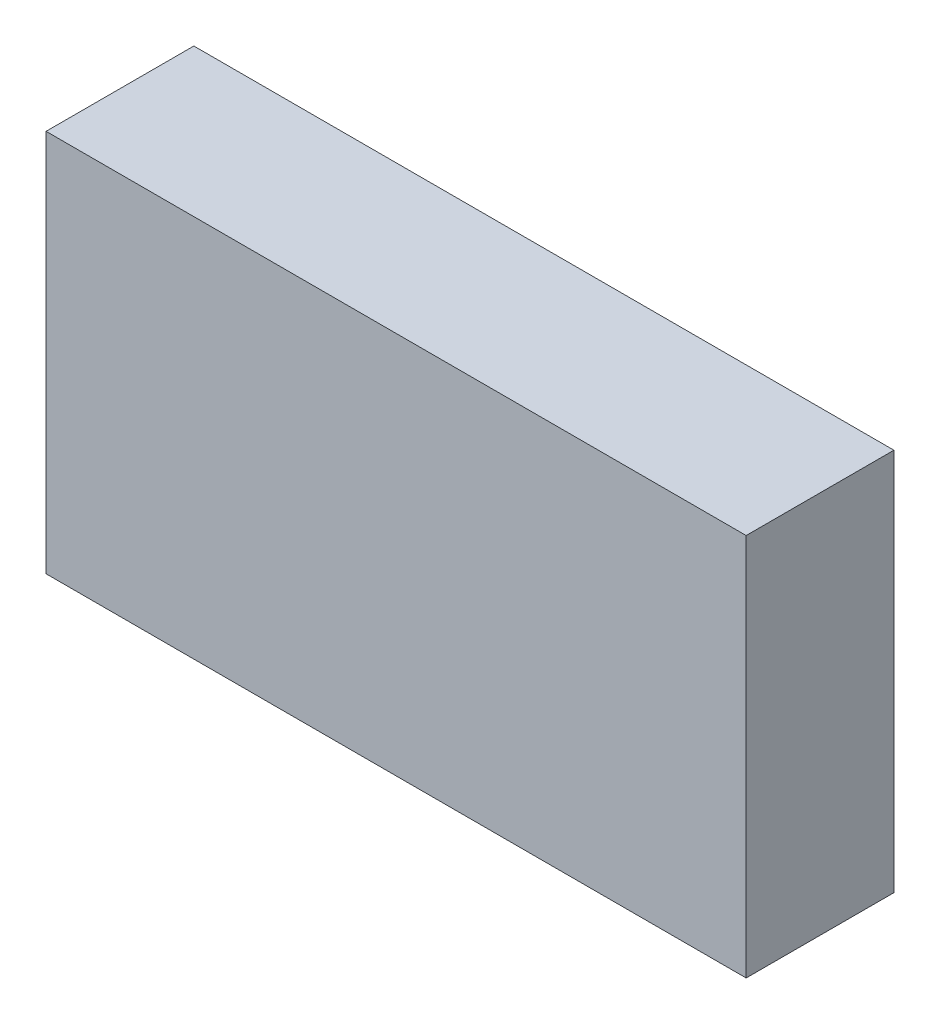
ISO-10303-21;
HEADER;
FILE_DESCRIPTION(('STEP AP214'),'2;1');
FILE_NAME('part.step','',(''),(''),'','','');
FILE_SCHEMA(('AUTOMOTIVE_DESIGN { 1 0 10303 214 1 1 1 1 }'));
ENDSEC;
DATA;
#1=APPLICATION_CONTEXT('core data for automotive mechanical design processes');
#2=APPLICATION_PROTOCOL_DEFINITION('international standard','automotive_design',2000,#1);
#3=PRODUCT_CONTEXT('',#1,'mechanical');
#4=PRODUCT('Part','Part','',(#3));
#5=PRODUCT_RELATED_PRODUCT_CATEGORY('part','',(#4));
#6=PRODUCT_DEFINITION_FORMATION('','',#4);
#7=PRODUCT_DEFINITION_CONTEXT('part definition',#1,'design');
#8=PRODUCT_DEFINITION('design','',#6,#7);
#9=PRODUCT_DEFINITION_SHAPE('','',#8);
#10=(LENGTH_UNIT() NAMED_UNIT(*) SI_UNIT(.MILLI.,.METRE.));
#11=(NAMED_UNIT(*) PLANE_ANGLE_UNIT() SI_UNIT($,.RADIAN.));
#12=(NAMED_UNIT(*) SI_UNIT($,.STERADIAN.) SOLID_ANGLE_UNIT());
#13=UNCERTAINTY_MEASURE_WITH_UNIT(LENGTH_MEASURE(1.E-05),#10,'distance_accuracy_value','');
#14=(GEOMETRIC_REPRESENTATION_CONTEXT(3) GLOBAL_UNCERTAINTY_ASSIGNED_CONTEXT((#13)) GLOBAL_UNIT_ASSIGNED_CONTEXT((#10,
#11,#12)) REPRESENTATION_CONTEXT('',''));
#15=CARTESIAN_POINT('',(0.,0.,0.));
#16=DIRECTION('',(0.,0.,1.));
#17=DIRECTION('',(1.,0.,0.));
#18=AXIS2_PLACEMENT_3D('',#15,#16,#17);
#19=CARTESIAN_POINT('',(-85.0123653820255,46.533357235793,35.8867617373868));
#20=DIRECTION('',(1.,0.,0.));
#21=DIRECTION('',(0.,1.,0.));
#22=AXIS2_PLACEMENT_3D('',#19,#20,#21);
#23=PLANE('',#22);
#24=DIRECTION('',(0.,-1.,0.));
#25=VECTOR('',#24,1.);
#26=CARTESIAN_POINT('',(-85.0123653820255,46.533357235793,0.));
#27=LINE('',#26,#25);
#28=CARTESIAN_POINT('',(-85.0123653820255,46.533357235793,0.));
#29=VERTEX_POINT('',#28);
#30=CARTESIAN_POINT('',(-85.0123653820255,-46.5333572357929,0.));
#31=VERTEX_POINT('',#30);
#32=EDGE_CURVE('E75',#29,#31,#27,.T.);
#33=ORIENTED_EDGE('',*,*,#32,.T.);
#34=DIRECTION('',(0.,0.,-1.));
#35=VECTOR('',#34,1.);
#36=CARTESIAN_POINT('',(-85.0123653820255,-46.5333572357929,35.8867617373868));
#37=LINE('',#36,#35);
#38=CARTESIAN_POINT('',(-85.0123653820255,-46.5333572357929,35.8867617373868));
#39=VERTEX_POINT('',#38);
#40=EDGE_CURVE('E11',#39,#31,#37,.T.);
#41=ORIENTED_EDGE('',*,*,#40,.F.);
#42=DIRECTION('',(0.,-1.,0.));
#43=VECTOR('',#42,1.);
#44=CARTESIAN_POINT('',(-85.0123653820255,46.533357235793,35.8867617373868));
#45=LINE('',#44,#43);
#46=CARTESIAN_POINT('',(-85.0123653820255,46.533357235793,35.8867617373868));
#47=VERTEX_POINT('',#46);
#48=EDGE_CURVE('E93',#47,#39,#45,.T.);
#49=ORIENTED_EDGE('',*,*,#48,.F.);
#50=DIRECTION('',(0.,0.,-1.));
#51=VECTOR('',#50,1.);
#52=CARTESIAN_POINT('',(-85.0123653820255,46.533357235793,35.8867617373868));
#53=LINE('',#52,#51);
#54=EDGE_CURVE('E87',#47,#29,#53,.T.);
#55=ORIENTED_EDGE('',*,*,#54,.T.);
#56=EDGE_LOOP('',(#33,#41,#49,#55));
#57=FACE_BOUND('',#56,.T.);
#58=ADVANCED_FACE('F31',(#57),#23,.F.);
#59=CARTESIAN_POINT('',(-85.0123653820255,-46.5333572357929,35.8867617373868));
#60=DIRECTION('',(0.,1.,0.));
#61=DIRECTION('',(0.,0.,1.));
#62=AXIS2_PLACEMENT_3D('',#59,#60,#61);
#63=PLANE('',#62);
#64=DIRECTION('',(1.,0.,0.));
#65=VECTOR('',#64,1.);
#66=CARTESIAN_POINT('',(-85.0123653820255,-46.5333572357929,0.));
#67=LINE('',#66,#65);
#68=CARTESIAN_POINT('',(85.0123653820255,-46.5333572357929,0.));
#69=VERTEX_POINT('',#68);
#70=EDGE_CURVE('E71',#31,#69,#67,.T.);
#71=ORIENTED_EDGE('',*,*,#70,.T.);
#72=DIRECTION('',(0.,0.,-1.));
#73=VECTOR('',#72,1.);
#74=CARTESIAN_POINT('',(85.0123653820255,-46.5333572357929,35.8867617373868));
#75=LINE('',#74,#73);
#76=CARTESIAN_POINT('',(85.0123653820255,-46.5333572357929,35.8867617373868));
#77=VERTEX_POINT('',#76);
#78=EDGE_CURVE('E38',#77,#69,#75,.T.);
#79=ORIENTED_EDGE('',*,*,#78,.F.);
#80=DIRECTION('',(1.,0.,0.));
#81=VECTOR('',#80,1.);
#82=CARTESIAN_POINT('',(-85.0123653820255,-46.5333572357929,35.8867617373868));
#83=LINE('',#82,#81);
#84=EDGE_CURVE('E83',#39,#77,#83,.T.);
#85=ORIENTED_EDGE('',*,*,#84,.F.);
#86=ORIENTED_EDGE('',*,*,#40,.T.);
#87=EDGE_LOOP('',(#71,#79,#85,#86));
#88=FACE_BOUND('',#87,.T.);
#89=ADVANCED_FACE('F82',(#88),#63,.F.);
#90=CARTESIAN_POINT('',(85.0123653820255,46.533357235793,35.8867617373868));
#91=DIRECTION('',(-1.,0.,0.));
#92=DIRECTION('',(0.,0.,1.));
#93=AXIS2_PLACEMENT_3D('',#90,#91,#92);
#94=PLANE('',#93);
#95=DIRECTION('',(0.,1.,0.));
#96=VECTOR('',#95,1.);
#97=CARTESIAN_POINT('',(85.0123653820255,46.533357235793,0.));
#98=LINE('',#97,#96);
#99=CARTESIAN_POINT('',(85.0123653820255,46.533357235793,0.));
#100=VERTEX_POINT('',#99);
#101=EDGE_CURVE('E76',#69,#100,#98,.T.);
#102=ORIENTED_EDGE('',*,*,#101,.T.);
#103=DIRECTION('',(0.,0.,-1.));
#104=VECTOR('',#103,1.);
#105=CARTESIAN_POINT('',(85.0123653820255,46.533357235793,35.8867617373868));
#106=LINE('',#105,#104);
#107=CARTESIAN_POINT('',(85.0123653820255,46.533357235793,35.8867617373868));
#108=VERTEX_POINT('',#107);
#109=EDGE_CURVE('E99',#108,#100,#106,.T.);
#110=ORIENTED_EDGE('',*,*,#109,.F.);
#111=DIRECTION('',(0.,1.,0.));
#112=VECTOR('',#111,1.);
#113=CARTESIAN_POINT('',(85.0123653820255,46.533357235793,35.8867617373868));
#114=LINE('',#113,#112);
#115=EDGE_CURVE('E50',#77,#108,#114,.T.);
#116=ORIENTED_EDGE('',*,*,#115,.F.);
#117=ORIENTED_EDGE('',*,*,#78,.T.);
#118=EDGE_LOOP('',(#102,#110,#116,#117));
#119=FACE_BOUND('',#118,.T.);
#120=ADVANCED_FACE('F102',(#119),#94,.F.);
#121=CARTESIAN_POINT('',(-85.0123653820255,46.533357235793,35.8867617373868));
#122=DIRECTION('',(0.,-1.,0.));
#123=DIRECTION('',(0.,0.,-1.));
#124=AXIS2_PLACEMENT_3D('',#121,#122,#123);
#125=PLANE('',#124);
#126=DIRECTION('',(-1.,0.,0.));
#127=VECTOR('',#126,1.);
#128=CARTESIAN_POINT('',(-85.0123653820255,46.533357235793,0.));
#129=LINE('',#128,#127);
#130=EDGE_CURVE('E91',#100,#29,#129,.T.);
#131=ORIENTED_EDGE('',*,*,#130,.T.);
#132=ORIENTED_EDGE('',*,*,#54,.F.);
#133=DIRECTION('',(-1.,0.,0.));
#134=VECTOR('',#133,1.);
#135=CARTESIAN_POINT('',(-85.0123653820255,46.533357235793,35.8867617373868));
#136=LINE('',#135,#134);
#137=EDGE_CURVE('E45',#108,#47,#136,.T.);
#138=ORIENTED_EDGE('',*,*,#137,.F.);
#139=ORIENTED_EDGE('',*,*,#109,.T.);
#140=EDGE_LOOP('',(#131,#132,#138,#139));
#141=FACE_BOUND('',#140,.T.);
#142=ADVANCED_FACE('F104',(#141),#125,.F.);
#143=CARTESIAN_POINT('',(-85.0123653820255,-46.5333572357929,35.8867617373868));
#144=DIRECTION('',(0.,0.,1.));
#145=DIRECTION('',(1.,0.,0.));
#146=AXIS2_PLACEMENT_3D('',#143,#144,#145);
#147=PLANE('',#146);
#148=ORIENTED_EDGE('',*,*,#48,.T.);
#149=ORIENTED_EDGE('',*,*,#84,.T.);
#150=ORIENTED_EDGE('',*,*,#115,.T.);
#151=ORIENTED_EDGE('',*,*,#137,.T.);
#152=EDGE_LOOP('',(#148,#149,#150,#151));
#153=FACE_BOUND('',#152,.T.);
#154=ADVANCED_FACE('F105',(#153),#147,.T.);
#155=CARTESIAN_POINT('',(-85.0123653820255,-46.5333572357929,0.));
#156=DIRECTION('',(0.,0.,1.));
#157=DIRECTION('',(1.,0.,0.));
#158=AXIS2_PLACEMENT_3D('',#155,#156,#157);
#159=PLANE('',#158);
#160=ORIENTED_EDGE('',*,*,#32,.F.);
#161=ORIENTED_EDGE('',*,*,#130,.F.);
#162=ORIENTED_EDGE('',*,*,#101,.F.);
#163=ORIENTED_EDGE('',*,*,#70,.F.);
#164=EDGE_LOOP('',(#160,#161,#162,#163));
#165=FACE_BOUND('',#164,.T.);
#166=ADVANCED_FACE('F72',(#165),#159,.F.);
#167=CLOSED_SHELL('',(#58,#89,#120,#142,#154,#166));
#168=MANIFOLD_SOLID_BREP('B2',#167);
#169=ADVANCED_BREP_SHAPE_REPRESENTATION('',(#18,#168),#14);
#170=SHAPE_DEFINITION_REPRESENTATION(#9,#169);
ENDSEC;
END-ISO-10303-21;
